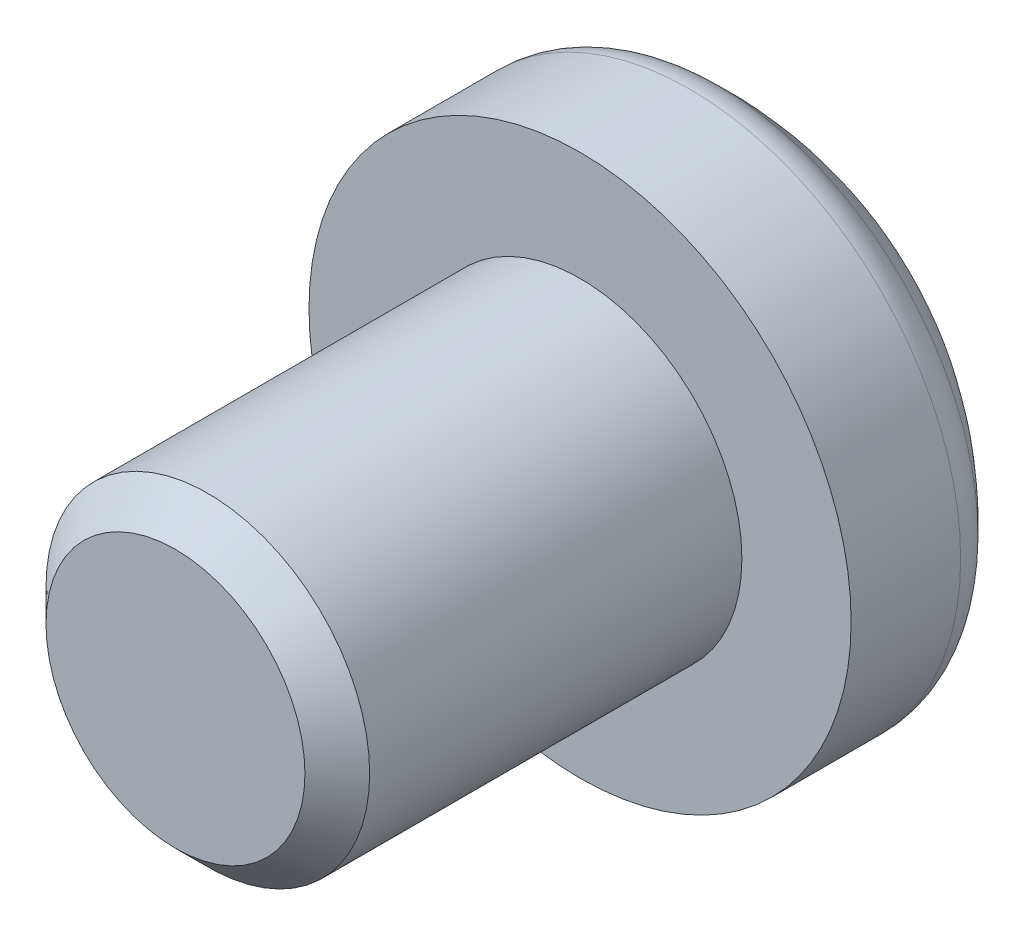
from build123d import *

# Parameters (mm, degrees)
ENLEV_MAT_EXTRU_1_DEPTH = 1
ESQUISSE3_W             = 2
ESQUISSE3_H             = 5
CHANFREIN1_SIZE         = 0.4


with BuildPart() as part:
    # Esquisse1 → Base-R_volution (revolve)
    with BuildSketch(Plane(origin=(0, 0, 0), x_dir=(1, 0, 0), z_dir=(0, 1, 0)), mode=Mode.PRIVATE) as base_r_volution_sk:
        with BuildLine():
            Line((0, 0), (3.35, 0))
            Line((3.35, 0), (3.35, 1.353412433))
            ThreePointArc((3.35, 1.353412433), (3.313933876, 1.543063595), (3.210770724, 1.706237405))
            ThreePointArc((3.210770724, 1.706237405), (1.750115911, 2.736530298), (0, 3.1))
            Line((0, 3.1), (0, 0))
        make_face()
    revolve(base_r_volution_sk.sketch.rotate(Axis((0, 0, 0), (0, 0, -1)), 180), axis=Axis((0, 0, 0), (0, 0, -1)))

    # Esquisse2 → Enlev. mat.-Extru.1 (cut)
    with BuildSketch(Plane.XY.offset(-3.1)):
        Polygon((0.6, -0.6), (0.6, -2.35), (-0.6, -2.35), (-0.6, -0.6), (-2.35, -0.6), (-2.35, 0.6), (-0.6, 0.6), (-0.6, 2.35), (0.6, 2.35), (0.6, 0.6), (2.35, 0.6), (2.35, -0.6), align=None)
    extrude(amount=ENLEV_MAT_EXTRU_1_DEPTH, mode=Mode.SUBTRACT)

    # Esquisse3 → Boss.-R_vol.1 (revolve)
    with BuildSketch(Plane(origin=(0, 0, 0), x_dir=(1, 0, 0), z_dir=(0, 1, 0)), mode=Mode.PRIVATE) as boss_r_vol_1_sk:
        with Locations((1, -2.5)):
            Rectangle(ESQUISSE3_W, ESQUISSE3_H)
    revolve(boss_r_vol_1_sk.sketch.rotate(Axis((0, 0, 0), (0, 0, 1)), 345.677280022), axis=Axis((0, 0, 0), (0, 0, 1)))

    # Chanfrein1
    chanfrein1_edges = [part.edges().sort_by_distance(p)[0] for p in [
        (-1.937835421, 0.494766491, 5),
    ]]
    chamfer(chanfrein1_edges, length=CHANFREIN1_SIZE)


solid = part.part
